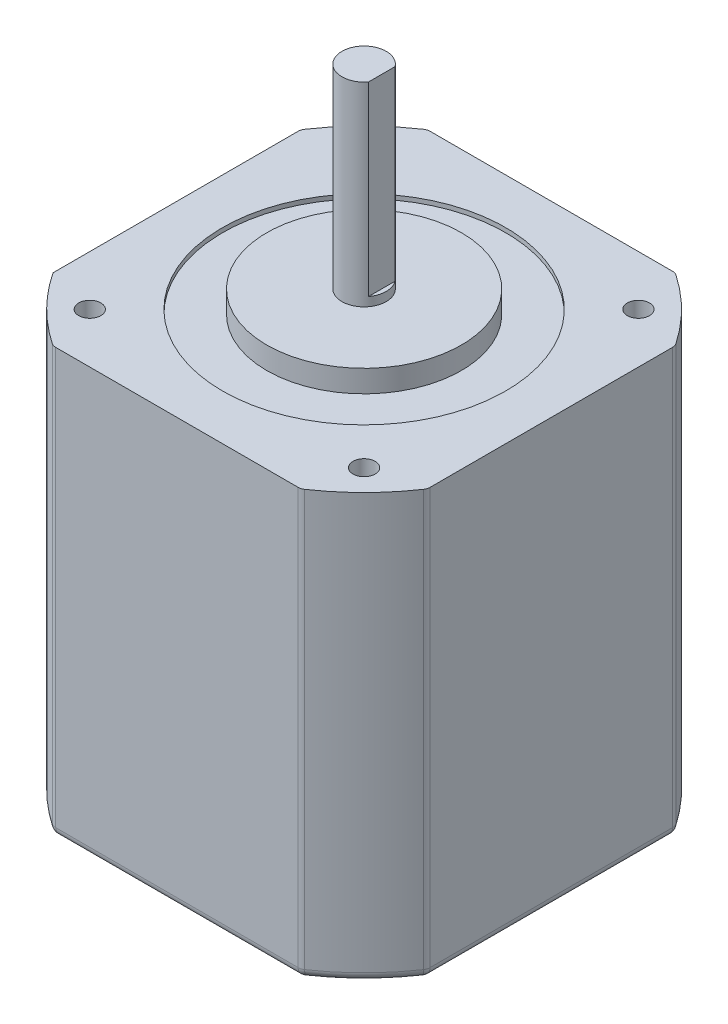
ISO-10303-21;
HEADER;
FILE_DESCRIPTION(('STEP AP214'),'2;1');
FILE_NAME('part.step','',(''),(''),'','','');
FILE_SCHEMA(('AUTOMOTIVE_DESIGN { 1 0 10303 214 1 1 1 1 }'));
ENDSEC;
DATA;
#1=APPLICATION_CONTEXT('core data for automotive mechanical design processes');
#2=APPLICATION_PROTOCOL_DEFINITION('international standard','automotive_design',2000,#1);
#3=PRODUCT_CONTEXT('',#1,'mechanical');
#4=PRODUCT('Part','Part','',(#3));
#5=PRODUCT_RELATED_PRODUCT_CATEGORY('part','',(#4));
#6=PRODUCT_DEFINITION_FORMATION('','',#4);
#7=PRODUCT_DEFINITION_CONTEXT('part definition',#1,'design');
#8=PRODUCT_DEFINITION('design','',#6,#7);
#9=PRODUCT_DEFINITION_SHAPE('','',#8);
#10=(LENGTH_UNIT() NAMED_UNIT(*) SI_UNIT(.MILLI.,.METRE.));
#11=(NAMED_UNIT(*) PLANE_ANGLE_UNIT() SI_UNIT($,.RADIAN.));
#12=(NAMED_UNIT(*) SI_UNIT($,.STERADIAN.) SOLID_ANGLE_UNIT());
#13=UNCERTAINTY_MEASURE_WITH_UNIT(LENGTH_MEASURE(1.E-05),#10,'distance_accuracy_value','');
#14=(GEOMETRIC_REPRESENTATION_CONTEXT(3) GLOBAL_UNCERTAINTY_ASSIGNED_CONTEXT((#13)) GLOBAL_UNIT_ASSIGNED_CONTEXT((#10,
#11,#12)) REPRESENTATION_CONTEXT('',''));
#15=CARTESIAN_POINT('',(0.,0.,0.));
#16=DIRECTION('',(0.,0.,1.));
#17=DIRECTION('',(1.,0.,0.));
#18=AXIS2_PLACEMENT_3D('',#15,#16,#17);
#19=CARTESIAN_POINT('',(0.,50.,0.));
#20=DIRECTION('',(0.,-1.,0.));
#21=DIRECTION('',(0.,0.,-1.));
#22=AXIS2_PLACEMENT_3D('',#19,#20,#21);
#23=CYLINDRICAL_SURFACE('',#22,11.);
#24=CARTESIAN_POINT('',(0.,50.,0.));
#25=DIRECTION('',(0.,1.,0.));
#26=DIRECTION('',(0.,0.,1.));
#27=AXIS2_PLACEMENT_3D('',#24,#25,#26);
#28=CIRCLE('',#27,11.);
#29=CARTESIAN_POINT('',(0.,50.,11.));
#30=VERTEX_POINT('',#29);
#31=EDGE_CURVE('E241',#30,#30,#28,.T.);
#32=ORIENTED_EDGE('',*,*,#31,.F.);
#33=EDGE_LOOP('',(#32));
#34=FACE_BOUND('',#33,.T.);
#35=CARTESIAN_POINT('',(0.,47.5,0.));
#36=DIRECTION('',(0.,1.,0.));
#37=DIRECTION('',(0.,0.,1.));
#38=AXIS2_PLACEMENT_3D('',#35,#36,#37);
#39=CIRCLE('',#38,11.);
#40=CARTESIAN_POINT('',(0.,47.5,11.));
#41=VERTEX_POINT('',#40);
#42=EDGE_CURVE('E569',#41,#41,#39,.T.);
#43=ORIENTED_EDGE('',*,*,#42,.T.);
#44=EDGE_LOOP('',(#43));
#45=FACE_BOUND('',#44,.T.);
#46=ADVANCED_FACE('F38',(#34,#45),#23,.T.);
#47=CARTESIAN_POINT('',(0.,50.,0.));
#48=DIRECTION('',(0.,1.,0.));
#49=DIRECTION('',(0.,0.,1.));
#50=AXIS2_PLACEMENT_3D('',#47,#48,#49);
#51=PLANE('',#50);
#52=CARTESIAN_POINT('',(0.,50.,0.));
#53=DIRECTION('',(0.,1.,0.));
#54=DIRECTION('',(0.,0.,1.));
#55=AXIS2_PLACEMENT_3D('',#52,#53,#54);
#56=CIRCLE('',#55,2.5);
#57=CARTESIAN_POINT('',(0.,50.,2.5));
#58=VERTEX_POINT('',#57);
#59=EDGE_CURVE('E236',#58,#58,#56,.T.);
#60=ORIENTED_EDGE('',*,*,#59,.F.);
#61=EDGE_LOOP('',(#60));
#62=FACE_BOUND('',#61,.T.);
#63=ORIENTED_EDGE('',*,*,#31,.T.);
#64=EDGE_LOOP('',(#63));
#65=FACE_BOUND('',#64,.T.);
#66=ADVANCED_FACE('F444',(#62,#65),#51,.T.);
#67=CARTESIAN_POINT('',(0.,72.0000000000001,0.));
#68=DIRECTION('',(0.,-1.,0.));
#69=DIRECTION('',(0.,0.,-1.));
#70=AXIS2_PLACEMENT_3D('',#67,#68,#69);
#71=CYLINDRICAL_SURFACE('',#70,2.5);
#72=CARTESIAN_POINT('',(0.,72.0000000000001,0.));
#73=DIRECTION('',(0.,1.,0.));
#74=DIRECTION('',(0.,0.,1.));
#75=AXIS2_PLACEMENT_3D('',#72,#73,#74);
#76=CIRCLE('',#75,2.5);
#77=CARTESIAN_POINT('',(2.,72.0000000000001,-1.5));
#78=VERTEX_POINT('',#77);
#79=CARTESIAN_POINT('',(2.,72.0000000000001,1.5));
#80=VERTEX_POINT('',#79);
#81=EDGE_CURVE('E238',#78,#80,#76,.T.);
#82=ORIENTED_EDGE('',*,*,#81,.F.);
#83=DIRECTION('',(0.,1.,0.));
#84=VECTOR('',#83,1.);
#85=CARTESIAN_POINT('',(2.,51.,-1.5));
#86=LINE('',#85,#84);
#87=CARTESIAN_POINT('',(2.,51.,-1.5));
#88=VERTEX_POINT('',#87);
#89=EDGE_CURVE('E231',#88,#78,#86,.T.);
#90=ORIENTED_EDGE('',*,*,#89,.F.);
#91=CARTESIAN_POINT('',(0.,51.,0.));
#92=DIRECTION('',(0.,1.,0.));
#93=DIRECTION('',(0.,0.,1.));
#94=AXIS2_PLACEMENT_3D('',#91,#92,#93);
#95=CIRCLE('',#94,2.5);
#96=CARTESIAN_POINT('',(2.,51.,1.5));
#97=VERTEX_POINT('',#96);
#98=EDGE_CURVE('E272',#97,#88,#95,.T.);
#99=ORIENTED_EDGE('',*,*,#98,.F.);
#100=DIRECTION('',(0.,1.,0.));
#101=VECTOR('',#100,1.);
#102=CARTESIAN_POINT('',(2.,51.,1.5));
#103=LINE('',#102,#101);
#104=EDGE_CURVE('E233',#97,#80,#103,.T.);
#105=ORIENTED_EDGE('',*,*,#104,.T.);
#106=EDGE_LOOP('',(#82,#90,#99,#105));
#107=FACE_BOUND('',#106,.T.);
#108=ORIENTED_EDGE('',*,*,#59,.T.);
#109=EDGE_LOOP('',(#108));
#110=FACE_BOUND('',#109,.T.);
#111=ADVANCED_FACE('F450',(#107,#110),#71,.T.);
#112=CARTESIAN_POINT('',(0.,72.0000000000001,0.));
#113=DIRECTION('',(0.,1.,0.));
#114=DIRECTION('',(0.,0.,1.));
#115=AXIS2_PLACEMENT_3D('',#112,#113,#114);
#116=PLANE('',#115);
#117=DIRECTION('',(0.,0.,1.));
#118=VECTOR('',#117,1.);
#119=CARTESIAN_POINT('',(2.,72.0000000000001,-1.5));
#120=LINE('',#119,#118);
#121=EDGE_CURVE('E227',#78,#80,#120,.T.);
#122=ORIENTED_EDGE('',*,*,#121,.F.);
#123=ORIENTED_EDGE('',*,*,#81,.T.);
#124=EDGE_LOOP('',(#122,#123));
#125=FACE_BOUND('',#124,.T.);
#126=ADVANCED_FACE('F878',(#125),#116,.T.);
#127=CARTESIAN_POINT('',(0.,51.,0.));
#128=DIRECTION('',(0.,1.,0.));
#129=DIRECTION('',(0.,0.,1.));
#130=AXIS2_PLACEMENT_3D('',#127,#128,#129);
#131=PLANE('',#130);
#132=DIRECTION('',(0.,0.,1.));
#133=VECTOR('',#132,1.);
#134=CARTESIAN_POINT('',(2.,51.,-1.5));
#135=LINE('',#134,#133);
#136=EDGE_CURVE('E228',#88,#97,#135,.T.);
#137=ORIENTED_EDGE('',*,*,#136,.T.);
#138=ORIENTED_EDGE('',*,*,#98,.T.);
#139=EDGE_LOOP('',(#137,#138));
#140=FACE_BOUND('',#139,.T.);
#141=ADVANCED_FACE('F868',(#140),#131,.T.);
#142=CARTESIAN_POINT('',(2.,51.,-1.5));
#143=DIRECTION('',(-1.,0.,0.));
#144=DIRECTION('',(0.,0.,1.));
#145=AXIS2_PLACEMENT_3D('',#142,#143,#144);
#146=PLANE('',#145);
#147=ORIENTED_EDGE('',*,*,#121,.T.);
#148=ORIENTED_EDGE('',*,*,#104,.F.);
#149=ORIENTED_EDGE('',*,*,#136,.F.);
#150=ORIENTED_EDGE('',*,*,#89,.T.);
#151=EDGE_LOOP('',(#147,#148,#149,#150));
#152=FACE_BOUND('',#151,.T.);
#153=ADVANCED_FACE('F584',(#152),#146,.F.);
#154=CARTESIAN_POINT('',(0.,47.5,0.));
#155=DIRECTION('',(0.,1.,0.));
#156=DIRECTION('',(0.,0.,1.));
#157=AXIS2_PLACEMENT_3D('',#154,#155,#156);
#158=CYLINDRICAL_SURFACE('',#157,16.);
#159=CARTESIAN_POINT('',(0.,47.5,0.));
#160=DIRECTION('',(0.,1.,0.));
#161=DIRECTION('',(0.,0.,1.));
#162=AXIS2_PLACEMENT_3D('',#159,#160,#161);
#163=CIRCLE('',#162,16.);
#164=CARTESIAN_POINT('',(0.,47.5,16.));
#165=VERTEX_POINT('',#164);
#166=EDGE_CURVE('E209',#165,#165,#163,.T.);
#167=ORIENTED_EDGE('',*,*,#166,.F.);
#168=EDGE_LOOP('',(#167));
#169=FACE_BOUND('',#168,.T.);
#170=CARTESIAN_POINT('',(0.,48.,0.));
#171=DIRECTION('',(0.,1.,0.));
#172=DIRECTION('',(0.,0.,1.));
#173=AXIS2_PLACEMENT_3D('',#170,#171,#172);
#174=CIRCLE('',#173,16.);
#175=CARTESIAN_POINT('',(0.,48.,16.));
#176=VERTEX_POINT('',#175);
#177=EDGE_CURVE('E572',#176,#176,#174,.T.);
#178=ORIENTED_EDGE('',*,*,#177,.T.);
#179=EDGE_LOOP('',(#178));
#180=FACE_BOUND('',#179,.T.);
#181=ADVANCED_FACE('F581',(#169,#180),#158,.F.);
#182=CARTESIAN_POINT('',(0.,47.5,0.));
#183=DIRECTION('',(0.,1.,0.));
#184=DIRECTION('',(0.,0.,1.));
#185=AXIS2_PLACEMENT_3D('',#182,#183,#184);
#186=PLANE('',#185);
#187=ORIENTED_EDGE('',*,*,#42,.F.);
#188=EDGE_LOOP('',(#187));
#189=FACE_BOUND('',#188,.T.);
#190=ORIENTED_EDGE('',*,*,#166,.T.);
#191=EDGE_LOOP('',(#190));
#192=FACE_BOUND('',#191,.T.);
#193=ADVANCED_FACE('F465',(#189,#192),#186,.T.);
#194=CARTESIAN_POINT('',(0.,0.,0.));
#195=DIRECTION('',(0.,-1.,0.));
#196=DIRECTION('',(0.,0.,-1.));
#197=AXIS2_PLACEMENT_3D('',#194,#195,#196);
#198=PLANE('',#197);
#199=CARTESIAN_POINT('',(0.,0.,0.));
#200=DIRECTION('',(0.,-1.,0.));
#201=DIRECTION('',(0.,0.,-1.));
#202=AXIS2_PLACEMENT_3D('',#199,#200,#201);
#203=CIRCLE('',#202,24.3636553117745);
#204=CARTESIAN_POINT('',(-20.15,0.,-13.6954445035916));
#205=VERTEX_POINT('',#204);
#206=CARTESIAN_POINT('',(-13.6954445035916,0.,-20.15));
#207=VERTEX_POINT('',#206);
#208=EDGE_CURVE('E293',#205,#207,#203,.T.);
#209=ORIENTED_EDGE('',*,*,#208,.T.);
#210=DIRECTION('',(-1.,0.,0.));
#211=VECTOR('',#210,1.);
#212=CARTESIAN_POINT('',(13.9997325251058,0.,-20.15));
#213=LINE('',#212,#211);
#214=CARTESIAN_POINT('',(13.6954445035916,0.,-20.15));
#215=VERTEX_POINT('',#214);
#216=EDGE_CURVE('E295',#207,#215,#213,.F.);
#217=ORIENTED_EDGE('',*,*,#216,.T.);
#218=CARTESIAN_POINT('',(0.,0.,0.));
#219=DIRECTION('',(0.,-1.,0.));
#220=DIRECTION('',(0.,0.,-1.));
#221=AXIS2_PLACEMENT_3D('',#218,#219,#220);
#222=CIRCLE('',#221,24.3636553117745);
#223=CARTESIAN_POINT('',(20.15,0.,-13.6954445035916));
#224=VERTEX_POINT('',#223);
#225=EDGE_CURVE('E281',#215,#224,#222,.T.);
#226=ORIENTED_EDGE('',*,*,#225,.T.);
#227=DIRECTION('',(0.,0.,-1.));
#228=VECTOR('',#227,1.);
#229=CARTESIAN_POINT('',(20.15,0.,13.9997325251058));
#230=LINE('',#229,#228);
#231=CARTESIAN_POINT('',(20.15,0.,13.6954445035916));
#232=VERTEX_POINT('',#231);
#233=EDGE_CURVE('E283',#224,#232,#230,.F.);
#234=ORIENTED_EDGE('',*,*,#233,.T.);
#235=CARTESIAN_POINT('',(0.,0.,0.));
#236=DIRECTION('',(0.,-1.,0.));
#237=DIRECTION('',(0.,0.,-1.));
#238=AXIS2_PLACEMENT_3D('',#235,#236,#237);
#239=CIRCLE('',#238,24.3636553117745);
#240=CARTESIAN_POINT('',(13.6954445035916,0.,20.15));
#241=VERTEX_POINT('',#240);
#242=EDGE_CURVE('E285',#232,#241,#239,.T.);
#243=ORIENTED_EDGE('',*,*,#242,.T.);
#244=DIRECTION('',(1.,0.,0.));
#245=VECTOR('',#244,1.);
#246=CARTESIAN_POINT('',(-13.9997325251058,0.,20.15));
#247=LINE('',#246,#245);
#248=CARTESIAN_POINT('',(-13.6954445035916,0.,20.15));
#249=VERTEX_POINT('',#248);
#250=EDGE_CURVE('E287',#241,#249,#247,.F.);
#251=ORIENTED_EDGE('',*,*,#250,.T.);
#252=CARTESIAN_POINT('',(0.,0.,0.));
#253=DIRECTION('',(0.,-1.,0.));
#254=DIRECTION('',(0.,0.,-1.));
#255=AXIS2_PLACEMENT_3D('',#252,#253,#254);
#256=CIRCLE('',#255,24.3636553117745);
#257=CARTESIAN_POINT('',(-20.15,0.,13.6954445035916));
#258=VERTEX_POINT('',#257);
#259=EDGE_CURVE('E289',#249,#258,#256,.T.);
#260=ORIENTED_EDGE('',*,*,#259,.T.);
#261=DIRECTION('',(0.,0.,1.));
#262=VECTOR('',#261,1.);
#263=CARTESIAN_POINT('',(-20.15,0.,-13.9997325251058));
#264=LINE('',#263,#262);
#265=EDGE_CURVE('E291',#258,#205,#264,.F.);
#266=ORIENTED_EDGE('',*,*,#265,.T.);
#267=EDGE_LOOP('',(#209,#217,#226,#234,#243,#251,#260,#266));
#268=FACE_BOUND('',#267,.T.);
#269=ADVANCED_FACE('F461',(#268),#198,.T.);
#270=CARTESIAN_POINT('',(-15.5,42.5,-15.5));
#271=DIRECTION('',(0.,1.,0.));
#272=DIRECTION('',(0.,0.,1.));
#273=AXIS2_PLACEMENT_3D('',#270,#271,#272);
#274=CONICAL_SURFACE('',#273,1.25,1.02974425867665);
#275=CARTESIAN_POINT('',(-15.5,41.7489242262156,-15.5));
#276=VERTEX_POINT('',#275);
#277=VERTEX_LOOP('',#276);
#278=FACE_BOUND('',#277,.T.);
#279=CARTESIAN_POINT('',(-15.5,42.5,-15.5));
#280=DIRECTION('',(0.,1.,0.));
#281=DIRECTION('',(0.,0.,1.));
#282=AXIS2_PLACEMENT_3D('',#279,#280,#281);
#283=CIRCLE('',#282,1.25);
#284=CARTESIAN_POINT('',(-15.5,42.5,-14.25));
#285=VERTEX_POINT('',#284);
#286=EDGE_CURVE('E224',#285,#285,#283,.T.);
#287=ORIENTED_EDGE('',*,*,#286,.T.);
#288=EDGE_LOOP('',(#287));
#289=FACE_BOUND('',#288,.T.);
#290=ADVANCED_FACE('F464',(#278,#289),#274,.F.);
#291=CARTESIAN_POINT('',(15.5,42.5,-15.5));
#292=DIRECTION('',(0.,1.,0.));
#293=DIRECTION('',(0.,0.,1.));
#294=AXIS2_PLACEMENT_3D('',#291,#292,#293);
#295=CONICAL_SURFACE('',#294,1.25,1.02974425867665);
#296=CARTESIAN_POINT('',(15.5,41.7489242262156,-15.5));
#297=VERTEX_POINT('',#296);
#298=VERTEX_LOOP('',#297);
#299=FACE_BOUND('',#298,.T.);
#300=CARTESIAN_POINT('',(15.5,42.5,-15.5));
#301=DIRECTION('',(0.,1.,0.));
#302=DIRECTION('',(0.,0.,1.));
#303=AXIS2_PLACEMENT_3D('',#300,#301,#302);
#304=CIRCLE('',#303,1.25);
#305=CARTESIAN_POINT('',(15.5,42.5,-14.25));
#306=VERTEX_POINT('',#305);
#307=EDGE_CURVE('E218',#306,#306,#304,.T.);
#308=ORIENTED_EDGE('',*,*,#307,.T.);
#309=EDGE_LOOP('',(#308));
#310=FACE_BOUND('',#309,.T.);
#311=ADVANCED_FACE('F827',(#299,#310),#295,.F.);
#312=CARTESIAN_POINT('',(15.5,42.5,15.5));
#313=DIRECTION('',(0.,1.,0.));
#314=DIRECTION('',(0.,0.,1.));
#315=AXIS2_PLACEMENT_3D('',#312,#313,#314);
#316=CONICAL_SURFACE('',#315,1.25,1.02974425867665);
#317=CARTESIAN_POINT('',(15.5,41.7489242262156,15.5));
#318=VERTEX_POINT('',#317);
#319=VERTEX_LOOP('',#318);
#320=FACE_BOUND('',#319,.T.);
#321=CARTESIAN_POINT('',(15.5,42.5,15.5));
#322=DIRECTION('',(0.,1.,0.));
#323=DIRECTION('',(0.,0.,1.));
#324=AXIS2_PLACEMENT_3D('',#321,#322,#323);
#325=CIRCLE('',#324,1.25);
#326=CARTESIAN_POINT('',(15.5,42.5,16.75));
#327=VERTEX_POINT('',#326);
#328=EDGE_CURVE('E206',#327,#327,#325,.T.);
#329=ORIENTED_EDGE('',*,*,#328,.T.);
#330=EDGE_LOOP('',(#329));
#331=FACE_BOUND('',#330,.T.);
#332=ADVANCED_FACE('F196',(#320,#331),#316,.F.);
#333=CARTESIAN_POINT('',(-15.5,42.5,15.5));
#334=DIRECTION('',(0.,1.,0.));
#335=DIRECTION('',(0.,0.,1.));
#336=AXIS2_PLACEMENT_3D('',#333,#334,#335);
#337=CONICAL_SURFACE('',#336,1.25,1.02974425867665);
#338=CARTESIAN_POINT('',(-15.5,41.7489242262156,15.5));
#339=VERTEX_POINT('',#338);
#340=VERTEX_LOOP('',#339);
#341=FACE_BOUND('',#340,.T.);
#342=CARTESIAN_POINT('',(-15.5,42.5,15.5));
#343=DIRECTION('',(0.,1.,0.));
#344=DIRECTION('',(0.,0.,1.));
#345=AXIS2_PLACEMENT_3D('',#342,#343,#344);
#346=CIRCLE('',#345,1.25);
#347=CARTESIAN_POINT('',(-15.5,42.5,16.75));
#348=VERTEX_POINT('',#347);
#349=EDGE_CURVE('E200',#348,#348,#346,.T.);
#350=ORIENTED_EDGE('',*,*,#349,.T.);
#351=EDGE_LOOP('',(#350));
#352=FACE_BOUND('',#351,.T.);
#353=ADVANCED_FACE('F192',(#341,#352),#337,.F.);
#354=CARTESIAN_POINT('',(21.15,48.,13.9997325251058));
#355=DIRECTION('',(-1.,0.,0.));
#356=DIRECTION('',(0.,0.,1.));
#357=AXIS2_PLACEMENT_3D('',#354,#355,#356);
#358=PLANE('',#357);
#359=DIRECTION('',(0.,0.,-1.));
#360=VECTOR('',#359,1.);
#361=CARTESIAN_POINT('',(21.15,1.,-13.9997325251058));
#362=LINE('',#361,#360);
#363=CARTESIAN_POINT('',(21.15,1.,13.6954445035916));
#364=VERTEX_POINT('',#363);
#365=CARTESIAN_POINT('',(21.15,1.,-13.6954445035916));
#366=VERTEX_POINT('',#365);
#367=EDGE_CURVE('E326',#364,#366,#362,.T.);
#368=ORIENTED_EDGE('',*,*,#367,.T.);
#369=DIRECTION('',(0.,-1.,0.));
#370=VECTOR('',#369,1.);
#371=CARTESIAN_POINT('',(21.15,48.,-13.6954445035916));
#372=LINE('',#371,#370);
#373=CARTESIAN_POINT('',(21.15,48.,-13.6954445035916));
#374=VERTEX_POINT('',#373);
#375=EDGE_CURVE('E328',#366,#374,#372,.F.);
#376=ORIENTED_EDGE('',*,*,#375,.T.);
#377=DIRECTION('',(0.,0.,-1.));
#378=VECTOR('',#377,1.);
#379=CARTESIAN_POINT('',(21.15,48.,13.9997325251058));
#380=LINE('',#379,#378);
#381=CARTESIAN_POINT('',(21.15,48.,13.6954445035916));
#382=VERTEX_POINT('',#381);
#383=EDGE_CURVE('E266',#382,#374,#380,.T.);
#384=ORIENTED_EDGE('',*,*,#383,.F.);
#385=DIRECTION('',(0.,-1.,0.));
#386=VECTOR('',#385,1.);
#387=CARTESIAN_POINT('',(21.15,48.,13.6954445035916));
#388=LINE('',#387,#386);
#389=EDGE_CURVE('E324',#382,#364,#388,.T.);
#390=ORIENTED_EDGE('',*,*,#389,.T.);
#391=EDGE_LOOP('',(#368,#376,#384,#390));
#392=FACE_BOUND('',#391,.T.);
#393=ADVANCED_FACE('F195',(#392),#358,.F.);
#394=CARTESIAN_POINT('',(0.,48.,0.));
#395=DIRECTION('',(0.,-1.,0.));
#396=DIRECTION('',(0.,0.,-1.));
#397=AXIS2_PLACEMENT_3D('',#394,#395,#396);
#398=CYLINDRICAL_SURFACE('',#397,25.3636553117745);
#399=CARTESIAN_POINT('',(0.,1.,0.));
#400=DIRECTION('',(0.,-1.,0.));
#401=DIRECTION('',(0.,0.,-1.));
#402=AXIS2_PLACEMENT_3D('',#399,#400,#401);
#403=CIRCLE('',#402,25.3636553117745);
#404=CARTESIAN_POINT('',(14.2575705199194,1.,20.9770515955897));
#405=VERTEX_POINT('',#404);
#406=CARTESIAN_POINT('',(20.9770515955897,1.,14.2575705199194));
#407=VERTEX_POINT('',#406);
#408=EDGE_CURVE('E320',#405,#407,#403,.F.);
#409=ORIENTED_EDGE('',*,*,#408,.T.);
#410=DIRECTION('',(0.,-1.,0.));
#411=VECTOR('',#410,1.);
#412=CARTESIAN_POINT('',(20.9770515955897,48.,14.2575705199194));
#413=LINE('',#412,#411);
#414=CARTESIAN_POINT('',(20.9770515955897,48.,14.2575705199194));
#415=VERTEX_POINT('',#414);
#416=EDGE_CURVE('E322',#407,#415,#413,.F.);
#417=ORIENTED_EDGE('',*,*,#416,.T.);
#418=CARTESIAN_POINT('',(0.,48.,0.));
#419=DIRECTION('',(0.,1.,0.));
#420=DIRECTION('',(0.,0.,1.));
#421=AXIS2_PLACEMENT_3D('',#418,#419,#420);
#422=CIRCLE('',#421,25.3636553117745);
#423=CARTESIAN_POINT('',(14.2575705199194,48.,20.9770515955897));
#424=VERTEX_POINT('',#423);
#425=EDGE_CURVE('E263',#424,#415,#422,.T.);
#426=ORIENTED_EDGE('',*,*,#425,.F.);
#427=DIRECTION('',(0.,-1.,0.));
#428=VECTOR('',#427,1.);
#429=CARTESIAN_POINT('',(14.2575705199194,48.,20.9770515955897));
#430=LINE('',#429,#428);
#431=EDGE_CURVE('E318',#424,#405,#430,.T.);
#432=ORIENTED_EDGE('',*,*,#431,.T.);
#433=EDGE_LOOP('',(#409,#417,#426,#432));
#434=FACE_BOUND('',#433,.T.);
#435=ADVANCED_FACE('F469',(#434),#398,.T.);
#436=CARTESIAN_POINT('',(13.9997325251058,48.,21.15));
#437=DIRECTION('',(0.,0.,-1.));
#438=DIRECTION('',(-1.,0.,0.));
#439=AXIS2_PLACEMENT_3D('',#436,#437,#438);
#440=PLANE('',#439);
#441=DIRECTION('',(1.,0.,0.));
#442=VECTOR('',#441,1.);
#443=CARTESIAN_POINT('',(13.9997325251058,1.,21.15));
#444=LINE('',#443,#442);
#445=CARTESIAN_POINT('',(-13.6954445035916,1.,21.15));
#446=VERTEX_POINT('',#445);
#447=CARTESIAN_POINT('',(13.6954445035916,1.,21.15));
#448=VERTEX_POINT('',#447);
#449=EDGE_CURVE('E314',#446,#448,#444,.T.);
#450=ORIENTED_EDGE('',*,*,#449,.T.);
#451=DIRECTION('',(0.,-1.,0.));
#452=VECTOR('',#451,1.);
#453=CARTESIAN_POINT('',(13.6954445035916,48.,21.15));
#454=LINE('',#453,#452);
#455=CARTESIAN_POINT('',(13.6954445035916,48.,21.15));
#456=VERTEX_POINT('',#455);
#457=EDGE_CURVE('E316',#448,#456,#454,.F.);
#458=ORIENTED_EDGE('',*,*,#457,.T.);
#459=DIRECTION('',(1.,0.,0.));
#460=VECTOR('',#459,1.);
#461=CARTESIAN_POINT('',(13.9997325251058,48.,21.15));
#462=LINE('',#461,#460);
#463=CARTESIAN_POINT('',(-13.6954445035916,48.,21.15));
#464=VERTEX_POINT('',#463);
#465=EDGE_CURVE('E260',#464,#456,#462,.T.);
#466=ORIENTED_EDGE('',*,*,#465,.F.);
#467=DIRECTION('',(0.,-1.,0.));
#468=VECTOR('',#467,1.);
#469=CARTESIAN_POINT('',(-13.6954445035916,48.,21.15));
#470=LINE('',#469,#468);
#471=EDGE_CURVE('E312',#464,#446,#470,.T.);
#472=ORIENTED_EDGE('',*,*,#471,.T.);
#473=EDGE_LOOP('',(#450,#458,#466,#472));
#474=FACE_BOUND('',#473,.T.);
#475=ADVANCED_FACE('F473',(#474),#440,.F.);
#476=CARTESIAN_POINT('',(0.,48.,0.));
#477=DIRECTION('',(0.,-1.,0.));
#478=DIRECTION('',(0.,0.,-1.));
#479=AXIS2_PLACEMENT_3D('',#476,#477,#478);
#480=CYLINDRICAL_SURFACE('',#479,25.3636553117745);
#481=DIRECTION('',(0.,-1.,0.));
#482=VECTOR('',#481,1.);
#483=CARTESIAN_POINT('',(-21.15,48.,13.9997325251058));
#484=LINE('',#483,#482);
#485=CARTESIAN_POINT('',(-21.15,48.,13.9997325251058));
#486=VERTEX_POINT('',#485);
#487=CARTESIAN_POINT('',(-21.15,1.,13.9997325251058));
#488=VERTEX_POINT('',#487);
#489=EDGE_CURVE('E269',#486,#488,#484,.T.);
#490=ORIENTED_EDGE('',*,*,#489,.T.);
#491=CARTESIAN_POINT('',(0.,1.,0.));
#492=DIRECTION('',(0.,-1.,0.));
#493=DIRECTION('',(0.,0.,-1.));
#494=AXIS2_PLACEMENT_3D('',#491,#492,#493);
#495=CIRCLE('',#494,25.3636553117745);
#496=CARTESIAN_POINT('',(-14.2575705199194,1.,20.9770515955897));
#497=VERTEX_POINT('',#496);
#498=EDGE_CURVE('E310',#488,#497,#495,.F.);
#499=ORIENTED_EDGE('',*,*,#498,.T.);
#500=DIRECTION('',(0.,-1.,0.));
#501=VECTOR('',#500,1.);
#502=CARTESIAN_POINT('',(-14.2575705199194,48.,20.9770515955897));
#503=LINE('',#502,#501);
#504=CARTESIAN_POINT('',(-14.2575705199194,48.,20.9770515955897));
#505=VERTEX_POINT('',#504);
#506=EDGE_CURVE('E308',#497,#505,#503,.F.);
#507=ORIENTED_EDGE('',*,*,#506,.T.);
#508=CARTESIAN_POINT('',(0.,48.,0.));
#509=DIRECTION('',(0.,1.,0.));
#510=DIRECTION('',(0.,0.,-1.));
#511=AXIS2_PLACEMENT_3D('',#508,#509,#510);
#512=CIRCLE('',#511,25.3636553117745);
#513=EDGE_CURVE('E257',#486,#505,#512,.T.);
#514=ORIENTED_EDGE('',*,*,#513,.F.);
#515=EDGE_LOOP('',(#490,#499,#507,#514));
#516=FACE_BOUND('',#515,.T.);
#517=ADVANCED_FACE('F477',(#516),#480,.T.);
#518=CARTESIAN_POINT('',(-21.15,48.,13.9997325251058));
#519=DIRECTION('',(1.,0.,0.));
#520=DIRECTION('',(0.,0.,-1.));
#521=AXIS2_PLACEMENT_3D('',#518,#519,#520);
#522=PLANE('',#521);
#523=DIRECTION('',(0.,-1.,0.));
#524=VECTOR('',#523,1.);
#525=CARTESIAN_POINT('',(-21.15,48.,-13.6954445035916));
#526=LINE('',#525,#524);
#527=CARTESIAN_POINT('',(-21.15,48.,-13.6954445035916));
#528=VERTEX_POINT('',#527);
#529=CARTESIAN_POINT('',(-21.15,1.,-13.6954445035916));
#530=VERTEX_POINT('',#529);
#531=EDGE_CURVE('E304',#528,#530,#526,.T.);
#532=ORIENTED_EDGE('',*,*,#531,.T.);
#533=DIRECTION('',(0.,0.,1.));
#534=VECTOR('',#533,1.);
#535=CARTESIAN_POINT('',(-21.15,1.,13.9997325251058));
#536=LINE('',#535,#534);
#537=EDGE_CURVE('E306',#530,#488,#536,.T.);
#538=ORIENTED_EDGE('',*,*,#537,.T.);
#539=ORIENTED_EDGE('',*,*,#489,.F.);
#540=DIRECTION('',(0.,0.,1.));
#541=VECTOR('',#540,1.);
#542=CARTESIAN_POINT('',(-21.15,48.,13.9997325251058));
#543=LINE('',#542,#541);
#544=EDGE_CURVE('E255',#528,#486,#543,.T.);
#545=ORIENTED_EDGE('',*,*,#544,.F.);
#546=EDGE_LOOP('',(#532,#538,#539,#545));
#547=FACE_BOUND('',#546,.T.);
#548=ADVANCED_FACE('F481',(#547),#522,.F.);
#549=CARTESIAN_POINT('',(0.,48.,0.));
#550=DIRECTION('',(0.,-1.,0.));
#551=DIRECTION('',(0.,0.,-1.));
#552=AXIS2_PLACEMENT_3D('',#549,#550,#551);
#553=CYLINDRICAL_SURFACE('',#552,25.3636553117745);
#554=CARTESIAN_POINT('',(0.,1.,0.));
#555=DIRECTION('',(0.,-1.,0.));
#556=DIRECTION('',(0.,0.,-1.));
#557=AXIS2_PLACEMENT_3D('',#554,#555,#556);
#558=CIRCLE('',#557,25.3636553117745);
#559=CARTESIAN_POINT('',(-14.2575705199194,1.,-20.9770515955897));
#560=VERTEX_POINT('',#559);
#561=CARTESIAN_POINT('',(-20.9770515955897,1.,-14.2575705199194));
#562=VERTEX_POINT('',#561);
#563=EDGE_CURVE('E300',#560,#562,#558,.F.);
#564=ORIENTED_EDGE('',*,*,#563,.T.);
#565=DIRECTION('',(0.,-1.,0.));
#566=VECTOR('',#565,1.);
#567=CARTESIAN_POINT('',(-20.9770515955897,48.,-14.2575705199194));
#568=LINE('',#567,#566);
#569=CARTESIAN_POINT('',(-20.9770515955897,48.,-14.2575705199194));
#570=VERTEX_POINT('',#569);
#571=EDGE_CURVE('E302',#562,#570,#568,.F.);
#572=ORIENTED_EDGE('',*,*,#571,.T.);
#573=CARTESIAN_POINT('',(0.,48.,0.));
#574=DIRECTION('',(0.,1.,0.));
#575=DIRECTION('',(0.,0.,1.));
#576=AXIS2_PLACEMENT_3D('',#573,#574,#575);
#577=CIRCLE('',#576,25.3636553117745);
#578=CARTESIAN_POINT('',(-14.2575705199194,48.,-20.9770515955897));
#579=VERTEX_POINT('',#578);
#580=EDGE_CURVE('E252',#579,#570,#577,.T.);
#581=ORIENTED_EDGE('',*,*,#580,.F.);
#582=DIRECTION('',(0.,-1.,0.));
#583=VECTOR('',#582,1.);
#584=CARTESIAN_POINT('',(-14.2575705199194,48.,-20.9770515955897));
#585=LINE('',#584,#583);
#586=EDGE_CURVE('E298',#579,#560,#585,.T.);
#587=ORIENTED_EDGE('',*,*,#586,.T.);
#588=EDGE_LOOP('',(#564,#572,#581,#587));
#589=FACE_BOUND('',#588,.T.);
#590=ADVANCED_FACE('F485',(#589),#553,.T.);
#591=CARTESIAN_POINT('',(13.9997325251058,48.,-21.15));
#592=DIRECTION('',(0.,0.,1.));
#593=DIRECTION('',(1.,0.,0.));
#594=AXIS2_PLACEMENT_3D('',#591,#592,#593);
#595=PLANE('',#594);
#596=DIRECTION('',(-1.,0.,0.));
#597=VECTOR('',#596,1.);
#598=CARTESIAN_POINT('',(-13.9997325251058,1.,-21.15));
#599=LINE('',#598,#597);
#600=CARTESIAN_POINT('',(13.6954445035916,1.,-21.15));
#601=VERTEX_POINT('',#600);
#602=CARTESIAN_POINT('',(-13.6954445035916,1.,-21.15));
#603=VERTEX_POINT('',#602);
#604=EDGE_CURVE('E276',#601,#603,#599,.T.);
#605=ORIENTED_EDGE('',*,*,#604,.T.);
#606=DIRECTION('',(0.,-1.,0.));
#607=VECTOR('',#606,1.);
#608=CARTESIAN_POINT('',(-13.6954445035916,48.,-21.15));
#609=LINE('',#608,#607);
#610=CARTESIAN_POINT('',(-13.6954445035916,48.,-21.15));
#611=VERTEX_POINT('',#610);
#612=EDGE_CURVE('E279',#603,#611,#609,.F.);
#613=ORIENTED_EDGE('',*,*,#612,.T.);
#614=DIRECTION('',(-1.,0.,0.));
#615=VECTOR('',#614,1.);
#616=CARTESIAN_POINT('',(13.9997325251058,48.,-21.15));
#617=LINE('',#616,#615);
#618=CARTESIAN_POINT('',(13.6954445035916,48.,-21.15));
#619=VERTEX_POINT('',#618);
#620=EDGE_CURVE('E249',#619,#611,#617,.T.);
#621=ORIENTED_EDGE('',*,*,#620,.F.);
#622=DIRECTION('',(0.,-1.,0.));
#623=VECTOR('',#622,1.);
#624=CARTESIAN_POINT('',(13.6954445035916,48.,-21.15));
#625=LINE('',#624,#623);
#626=EDGE_CURVE('E274',#619,#601,#625,.T.);
#627=ORIENTED_EDGE('',*,*,#626,.T.);
#628=EDGE_LOOP('',(#605,#613,#621,#627));
#629=FACE_BOUND('',#628,.T.);
#630=ADVANCED_FACE('F489',(#629),#595,.F.);
#631=CARTESIAN_POINT('',(0.,48.,0.));
#632=DIRECTION('',(0.,-1.,0.));
#633=DIRECTION('',(0.,0.,-1.));
#634=AXIS2_PLACEMENT_3D('',#631,#632,#633);
#635=CYLINDRICAL_SURFACE('',#634,25.3636553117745);
#636=CARTESIAN_POINT('',(0.,1.,0.));
#637=DIRECTION('',(0.,-1.,0.));
#638=DIRECTION('',(0.,0.,-1.));
#639=AXIS2_PLACEMENT_3D('',#636,#637,#638);
#640=CIRCLE('',#639,25.3636553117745);
#641=CARTESIAN_POINT('',(20.9770515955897,1.,-14.2575705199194));
#642=VERTEX_POINT('',#641);
#643=CARTESIAN_POINT('',(14.2575705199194,1.,-20.9770515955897));
#644=VERTEX_POINT('',#643);
#645=EDGE_CURVE('E55',#642,#644,#640,.F.);
#646=ORIENTED_EDGE('',*,*,#645,.T.);
#647=DIRECTION('',(0.,-1.,0.));
#648=VECTOR('',#647,1.);
#649=CARTESIAN_POINT('',(14.2575705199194,48.,-20.9770515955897));
#650=LINE('',#649,#648);
#651=CARTESIAN_POINT('',(14.2575705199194,48.,-20.9770515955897));
#652=VERTEX_POINT('',#651);
#653=EDGE_CURVE('E332',#644,#652,#650,.F.);
#654=ORIENTED_EDGE('',*,*,#653,.T.);
#655=CARTESIAN_POINT('',(0.,48.,0.));
#656=DIRECTION('',(0.,1.,0.));
#657=DIRECTION('',(0.,0.,-1.));
#658=AXIS2_PLACEMENT_3D('',#655,#656,#657);
#659=CIRCLE('',#658,25.3636553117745);
#660=CARTESIAN_POINT('',(20.9770515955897,48.,-14.2575705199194));
#661=VERTEX_POINT('',#660);
#662=EDGE_CURVE('E246',#661,#652,#659,.T.);
#663=ORIENTED_EDGE('',*,*,#662,.F.);
#664=DIRECTION('',(0.,-1.,0.));
#665=VECTOR('',#664,1.);
#666=CARTESIAN_POINT('',(20.9770515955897,48.,-14.2575705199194));
#667=LINE('',#666,#665);
#668=EDGE_CURVE('E60',#661,#642,#667,.T.);
#669=ORIENTED_EDGE('',*,*,#668,.T.);
#670=EDGE_LOOP('',(#646,#654,#663,#669));
#671=FACE_BOUND('',#670,.T.);
#672=ADVANCED_FACE('F493',(#671),#635,.T.);
#673=CARTESIAN_POINT('',(-15.5,48.,-15.5));
#674=DIRECTION('',(0.,1.,0.));
#675=DIRECTION('',(0.,0.,1.));
#676=AXIS2_PLACEMENT_3D('',#673,#674,#675);
#677=CYLINDRICAL_SURFACE('',#676,1.24999999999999);
#678=ORIENTED_EDGE('',*,*,#286,.F.);
#679=EDGE_LOOP('',(#678));
#680=FACE_BOUND('',#679,.T.);
#681=CARTESIAN_POINT('',(-15.5,48.,-15.5));
#682=DIRECTION('',(0.,1.,0.));
#683=DIRECTION('',(0.,0.,1.));
#684=AXIS2_PLACEMENT_3D('',#681,#682,#683);
#685=CIRCLE('',#684,1.24999999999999);
#686=CARTESIAN_POINT('',(-15.5,48.,-14.25));
#687=VERTEX_POINT('',#686);
#688=EDGE_CURVE('E221',#687,#687,#685,.T.);
#689=ORIENTED_EDGE('',*,*,#688,.T.);
#690=EDGE_LOOP('',(#689));
#691=FACE_BOUND('',#690,.T.);
#692=ADVANCED_FACE('F497',(#680,#691),#677,.F.);
#693=CARTESIAN_POINT('',(15.5,48.,-15.5));
#694=DIRECTION('',(0.,1.,0.));
#695=DIRECTION('',(0.,0.,1.));
#696=AXIS2_PLACEMENT_3D('',#693,#694,#695);
#697=CYLINDRICAL_SURFACE('',#696,1.24999999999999);
#698=ORIENTED_EDGE('',*,*,#307,.F.);
#699=EDGE_LOOP('',(#698));
#700=FACE_BOUND('',#699,.T.);
#701=CARTESIAN_POINT('',(15.5,48.,-15.5));
#702=DIRECTION('',(0.,1.,0.));
#703=DIRECTION('',(0.,0.,1.));
#704=AXIS2_PLACEMENT_3D('',#701,#702,#703);
#705=CIRCLE('',#704,1.24999999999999);
#706=CARTESIAN_POINT('',(15.5,48.,-14.25));
#707=VERTEX_POINT('',#706);
#708=EDGE_CURVE('E215',#707,#707,#705,.T.);
#709=ORIENTED_EDGE('',*,*,#708,.T.);
#710=EDGE_LOOP('',(#709));
#711=FACE_BOUND('',#710,.T.);
#712=ADVANCED_FACE('F817',(#700,#711),#697,.F.);
#713=CARTESIAN_POINT('',(15.5,48.,15.5));
#714=DIRECTION('',(0.,1.,0.));
#715=DIRECTION('',(0.,0.,1.));
#716=AXIS2_PLACEMENT_3D('',#713,#714,#715);
#717=CYLINDRICAL_SURFACE('',#716,1.24999999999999);
#718=ORIENTED_EDGE('',*,*,#328,.F.);
#719=EDGE_LOOP('',(#718));
#720=FACE_BOUND('',#719,.T.);
#721=CARTESIAN_POINT('',(15.5,48.,15.5));
#722=DIRECTION('',(0.,1.,0.));
#723=DIRECTION('',(0.,0.,1.));
#724=AXIS2_PLACEMENT_3D('',#721,#722,#723);
#725=CIRCLE('',#724,1.24999999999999);
#726=CARTESIAN_POINT('',(15.5,48.,16.75));
#727=VERTEX_POINT('',#726);
#728=EDGE_CURVE('E202',#727,#727,#725,.T.);
#729=ORIENTED_EDGE('',*,*,#728,.T.);
#730=EDGE_LOOP('',(#729));
#731=FACE_BOUND('',#730,.T.);
#732=ADVANCED_FACE('F800',(#720,#731),#717,.F.);
#733=CARTESIAN_POINT('',(-15.5,48.,15.5));
#734=DIRECTION('',(0.,1.,0.));
#735=DIRECTION('',(0.,0.,1.));
#736=AXIS2_PLACEMENT_3D('',#733,#734,#735);
#737=CYLINDRICAL_SURFACE('',#736,1.24999999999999);
#738=ORIENTED_EDGE('',*,*,#349,.F.);
#739=EDGE_LOOP('',(#738));
#740=FACE_BOUND('',#739,.T.);
#741=CARTESIAN_POINT('',(-15.5,48.,15.5));
#742=DIRECTION('',(0.,1.,0.));
#743=DIRECTION('',(0.,0.,1.));
#744=AXIS2_PLACEMENT_3D('',#741,#742,#743);
#745=CIRCLE('',#744,1.24999999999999);
#746=CARTESIAN_POINT('',(-15.5,48.,16.75));
#747=VERTEX_POINT('',#746);
#748=EDGE_CURVE('E203',#747,#747,#745,.T.);
#749=ORIENTED_EDGE('',*,*,#748,.T.);
#750=EDGE_LOOP('',(#749));
#751=FACE_BOUND('',#750,.T.);
#752=ADVANCED_FACE('F459',(#740,#751),#737,.F.);
#753=CARTESIAN_POINT('',(0.,48.,0.));
#754=DIRECTION('',(0.,-1.,0.));
#755=DIRECTION('',(0.,0.,-1.));
#756=AXIS2_PLACEMENT_3D('',#753,#754,#755);
#757=PLANE('',#756);
#758=ORIENTED_EDGE('',*,*,#177,.F.);
#759=EDGE_LOOP('',(#758));
#760=FACE_BOUND('',#759,.T.);
#761=ORIENTED_EDGE('',*,*,#748,.F.);
#762=EDGE_LOOP('',(#761));
#763=FACE_BOUND('',#762,.T.);
#764=ORIENTED_EDGE('',*,*,#728,.F.);
#765=EDGE_LOOP('',(#764));
#766=FACE_BOUND('',#765,.T.);
#767=ORIENTED_EDGE('',*,*,#708,.F.);
#768=EDGE_LOOP('',(#767));
#769=FACE_BOUND('',#768,.T.);
#770=ORIENTED_EDGE('',*,*,#688,.F.);
#771=EDGE_LOOP('',(#770));
#772=FACE_BOUND('',#771,.T.);
#773=ORIENTED_EDGE('',*,*,#580,.T.);
#774=CARTESIAN_POINT('',(-20.15,48.,-13.6954445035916));
#775=DIRECTION('',(0.,-1.,0.));
#776=DIRECTION('',(0.,0.,-1.));
#777=AXIS2_PLACEMENT_3D('',#774,#775,#776);
#778=CIRCLE('',#777,1.);
#779=EDGE_CURVE('E11',#570,#528,#778,.F.);
#780=ORIENTED_EDGE('',*,*,#779,.T.);
#781=ORIENTED_EDGE('',*,*,#544,.T.);
#782=ORIENTED_EDGE('',*,*,#513,.T.);
#783=CARTESIAN_POINT('',(-13.6954445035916,48.,20.15));
#784=DIRECTION('',(0.,-1.,0.));
#785=DIRECTION('',(0.,0.,-1.));
#786=AXIS2_PLACEMENT_3D('',#783,#784,#785);
#787=CIRCLE('',#786,1.);
#788=EDGE_CURVE('E334',#505,#464,#787,.F.);
#789=ORIENTED_EDGE('',*,*,#788,.T.);
#790=ORIENTED_EDGE('',*,*,#465,.T.);
#791=CARTESIAN_POINT('',(13.6954445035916,48.,20.15));
#792=DIRECTION('',(0.,-1.,0.));
#793=DIRECTION('',(0.,0.,-1.));
#794=AXIS2_PLACEMENT_3D('',#791,#792,#793);
#795=CIRCLE('',#794,1.);
#796=EDGE_CURVE('E336',#456,#424,#795,.F.);
#797=ORIENTED_EDGE('',*,*,#796,.T.);
#798=ORIENTED_EDGE('',*,*,#425,.T.);
#799=CARTESIAN_POINT('',(20.15,48.,13.6954445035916));
#800=DIRECTION('',(0.,-1.,0.));
#801=DIRECTION('',(0.,0.,-1.));
#802=AXIS2_PLACEMENT_3D('',#799,#800,#801);
#803=CIRCLE('',#802,1.);
#804=EDGE_CURVE('E338',#415,#382,#803,.F.);
#805=ORIENTED_EDGE('',*,*,#804,.T.);
#806=ORIENTED_EDGE('',*,*,#383,.T.);
#807=CARTESIAN_POINT('',(20.15,48.,-13.6954445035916));
#808=DIRECTION('',(0.,-1.,0.));
#809=DIRECTION('',(0.,0.,-1.));
#810=AXIS2_PLACEMENT_3D('',#807,#808,#809);
#811=CIRCLE('',#810,1.);
#812=EDGE_CURVE('E340',#374,#661,#811,.F.);
#813=ORIENTED_EDGE('',*,*,#812,.T.);
#814=ORIENTED_EDGE('',*,*,#662,.T.);
#815=CARTESIAN_POINT('',(13.6954445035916,48.,-20.15));
#816=DIRECTION('',(0.,-1.,0.));
#817=DIRECTION('',(0.,0.,-1.));
#818=AXIS2_PLACEMENT_3D('',#815,#816,#817);
#819=CIRCLE('',#818,1.);
#820=EDGE_CURVE('E342',#652,#619,#819,.F.);
#821=ORIENTED_EDGE('',*,*,#820,.T.);
#822=ORIENTED_EDGE('',*,*,#620,.T.);
#823=CARTESIAN_POINT('',(-13.6954445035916,48.,-20.15));
#824=DIRECTION('',(0.,-1.,0.));
#825=DIRECTION('',(0.,0.,-1.));
#826=AXIS2_PLACEMENT_3D('',#823,#824,#825);
#827=CIRCLE('',#826,1.);
#828=EDGE_CURVE('E47',#611,#579,#827,.F.);
#829=ORIENTED_EDGE('',*,*,#828,.T.);
#830=EDGE_LOOP('',(#773,#780,#781,#782,#789,#790,#797,#798,#805,#806,#813,#814,#821,#822,#829));
#831=FACE_BOUND('',#830,.T.);
#832=ADVANCED_FACE('F440',(#760,#763,#766,#769,#772,#831),#757,.F.);
#833=CARTESIAN_POINT('',(13.6954445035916,48.,20.15));
#834=DIRECTION('',(0.,-1.,0.));
#835=DIRECTION('',(0.,0.,-1.));
#836=AXIS2_PLACEMENT_3D('',#833,#834,#835);
#837=CYLINDRICAL_SURFACE('',#836,1.);
#838=CARTESIAN_POINT('',(13.6954445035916,1.,20.15));
#839=DIRECTION('',(0.,-1.,0.));
#840=DIRECTION('',(0.,0.,-1.));
#841=AXIS2_PLACEMENT_3D('',#838,#839,#840);
#842=CIRCLE('',#841,1.);
#843=EDGE_CURVE('E42',#405,#448,#842,.T.);
#844=ORIENTED_EDGE('',*,*,#843,.F.);
#845=ORIENTED_EDGE('',*,*,#431,.F.);
#846=ORIENTED_EDGE('',*,*,#796,.F.);
#847=ORIENTED_EDGE('',*,*,#457,.F.);
#848=EDGE_LOOP('',(#844,#845,#846,#847));
#849=FACE_BOUND('',#848,.T.);
#850=ADVANCED_FACE('F40',(#849),#837,.T.);
#851=CARTESIAN_POINT('',(13.6954445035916,1.,20.15));
#852=DIRECTION('',(0.,0.,1.));
#853=DIRECTION('',(1.,0.,0.));
#854=AXIS2_PLACEMENT_3D('',#851,#852,#853);
#855=SPHERICAL_SURFACE('',#854,1.);
#856=CARTESIAN_POINT('',(13.6954445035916,1.,20.15));
#857=DIRECTION('',(-0.82705159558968,0.,0.562126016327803));
#858=DIRECTION('',(0.562126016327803,0.,0.82705159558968));
#859=AXIS2_PLACEMENT_3D('',#856,#857,#858);
#860=CIRCLE('',#859,1.);
#861=EDGE_CURVE('E550',#405,#241,#860,.F.);
#862=ORIENTED_EDGE('',*,*,#861,.F.);
#863=ORIENTED_EDGE('',*,*,#843,.T.);
#864=CARTESIAN_POINT('',(13.6954445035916,1.,20.15));
#865=DIRECTION('',(1.,0.,0.));
#866=DIRECTION('',(0.,1.,0.));
#867=AXIS2_PLACEMENT_3D('',#864,#865,#866);
#868=CIRCLE('',#867,1.);
#869=EDGE_CURVE('E564',#241,#448,#868,.F.);
#870=ORIENTED_EDGE('',*,*,#869,.F.);
#871=EDGE_LOOP('',(#862,#863,#870));
#872=FACE_BOUND('',#871,.T.);
#873=ADVANCED_FACE('F433',(#872),#855,.T.);
#874=CARTESIAN_POINT('',(-13.6954445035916,48.,20.15));
#875=DIRECTION('',(0.,-1.,0.));
#876=DIRECTION('',(0.,0.,-1.));
#877=AXIS2_PLACEMENT_3D('',#874,#875,#876);
#878=CYLINDRICAL_SURFACE('',#877,1.);
#879=ORIENTED_EDGE('',*,*,#788,.F.);
#880=ORIENTED_EDGE('',*,*,#506,.F.);
#881=CARTESIAN_POINT('',(-13.6954445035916,1.,20.15));
#882=DIRECTION('',(0.,-1.,0.));
#883=DIRECTION('',(0.,0.,-1.));
#884=AXIS2_PLACEMENT_3D('',#881,#882,#883);
#885=CIRCLE('',#884,1.);
#886=EDGE_CURVE('E557',#446,#497,#885,.T.);
#887=ORIENTED_EDGE('',*,*,#886,.F.);
#888=ORIENTED_EDGE('',*,*,#471,.F.);
#889=EDGE_LOOP('',(#879,#880,#887,#888));
#890=FACE_BOUND('',#889,.T.);
#891=ADVANCED_FACE('F430',(#890),#878,.T.);
#892=CARTESIAN_POINT('',(13.9997325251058,1.,20.15));
#893=DIRECTION('',(-1.,0.,0.));
#894=DIRECTION('',(0.,0.,1.));
#895=AXIS2_PLACEMENT_3D('',#892,#893,#894);
#896=CYLINDRICAL_SURFACE('',#895,1.);
#897=ORIENTED_EDGE('',*,*,#869,.T.);
#898=ORIENTED_EDGE('',*,*,#449,.F.);
#899=CARTESIAN_POINT('',(-13.6954445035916,1.,20.15));
#900=DIRECTION('',(-1.,0.,0.));
#901=DIRECTION('',(0.,0.,1.));
#902=AXIS2_PLACEMENT_3D('',#899,#900,#901);
#903=CIRCLE('',#902,1.);
#904=EDGE_CURVE('E554',#249,#446,#903,.T.);
#905=ORIENTED_EDGE('',*,*,#904,.F.);
#906=ORIENTED_EDGE('',*,*,#250,.F.);
#907=EDGE_LOOP('',(#897,#898,#905,#906));
#908=FACE_BOUND('',#907,.T.);
#909=ADVANCED_FACE('F426',(#908),#896,.T.);
#910=CARTESIAN_POINT('',(0.,1.,0.));
#911=DIRECTION('',(0.,-1.,0.));
#912=DIRECTION('',(0.,0.,-1.));
#913=AXIS2_PLACEMENT_3D('',#910,#911,#912);
#914=TOROIDAL_SURFACE('',#913,24.3636553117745,1.);
#915=ORIENTED_EDGE('',*,*,#861,.T.);
#916=ORIENTED_EDGE('',*,*,#242,.F.);
#917=CARTESIAN_POINT('',(20.15,1.,13.6954445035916));
#918=DIRECTION('',(0.562126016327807,0.,-0.827051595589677));
#919=DIRECTION('',(-0.827051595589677,0.,-0.562126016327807));
#920=AXIS2_PLACEMENT_3D('',#917,#918,#919);
#921=CIRCLE('',#920,1.);
#922=EDGE_CURVE('E548',#407,#232,#921,.T.);
#923=ORIENTED_EDGE('',*,*,#922,.F.);
#924=ORIENTED_EDGE('',*,*,#408,.F.);
#925=EDGE_LOOP('',(#915,#916,#923,#924));
#926=FACE_BOUND('',#925,.T.);
#927=ADVANCED_FACE('F422',(#926),#914,.T.);
#928=CARTESIAN_POINT('',(20.15,48.,13.6954445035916));
#929=DIRECTION('',(0.,-1.,0.));
#930=DIRECTION('',(0.,0.,-1.));
#931=AXIS2_PLACEMENT_3D('',#928,#929,#930);
#932=CYLINDRICAL_SURFACE('',#931,1.);
#933=ORIENTED_EDGE('',*,*,#804,.F.);
#934=ORIENTED_EDGE('',*,*,#416,.F.);
#935=CARTESIAN_POINT('',(20.15,1.,13.6954445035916));
#936=DIRECTION('',(0.,-1.,0.));
#937=DIRECTION('',(0.,0.,-1.));
#938=AXIS2_PLACEMENT_3D('',#935,#936,#937);
#939=CIRCLE('',#938,1.);
#940=EDGE_CURVE('E553',#364,#407,#939,.T.);
#941=ORIENTED_EDGE('',*,*,#940,.F.);
#942=ORIENTED_EDGE('',*,*,#389,.F.);
#943=EDGE_LOOP('',(#933,#934,#941,#942));
#944=FACE_BOUND('',#943,.T.);
#945=ADVANCED_FACE('F418',(#944),#932,.T.);
#946=CARTESIAN_POINT('',(-13.6954445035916,1.,20.15));
#947=DIRECTION('',(0.,0.,1.));
#948=DIRECTION('',(1.,0.,0.));
#949=AXIS2_PLACEMENT_3D('',#946,#947,#948);
#950=SPHERICAL_SURFACE('',#949,1.);
#951=ORIENTED_EDGE('',*,*,#904,.T.);
#952=ORIENTED_EDGE('',*,*,#886,.T.);
#953=CARTESIAN_POINT('',(-13.6954445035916,1.,20.15));
#954=DIRECTION('',(0.827051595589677,0.,0.562126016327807));
#955=DIRECTION('',(0.562126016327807,0.,-0.827051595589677));
#956=AXIS2_PLACEMENT_3D('',#953,#954,#955);
#957=CIRCLE('',#956,1.);
#958=EDGE_CURVE('E559',#249,#497,#957,.F.);
#959=ORIENTED_EDGE('',*,*,#958,.F.);
#960=EDGE_LOOP('',(#951,#952,#959));
#961=FACE_BOUND('',#960,.T.);
#962=ADVANCED_FACE('F414',(#961),#950,.T.);
#963=CARTESIAN_POINT('',(20.15,1.,13.6954445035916));
#964=DIRECTION('',(0.,0.,1.));
#965=DIRECTION('',(1.,0.,0.));
#966=AXIS2_PLACEMENT_3D('',#963,#964,#965);
#967=SPHERICAL_SURFACE('',#966,1.);
#968=ORIENTED_EDGE('',*,*,#940,.T.);
#969=ORIENTED_EDGE('',*,*,#922,.T.);
#970=CARTESIAN_POINT('',(20.15,1.,13.6954445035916));
#971=DIRECTION('',(0.,0.,1.));
#972=DIRECTION('',(1.,0.,0.));
#973=AXIS2_PLACEMENT_3D('',#970,#971,#972);
#974=CIRCLE('',#973,1.);
#975=EDGE_CURVE('E388',#364,#232,#974,.F.);
#976=ORIENTED_EDGE('',*,*,#975,.F.);
#977=EDGE_LOOP('',(#968,#969,#976));
#978=FACE_BOUND('',#977,.T.);
#979=ADVANCED_FACE('F411',(#978),#967,.T.);
#980=CARTESIAN_POINT('',(0.,1.,0.));
#981=DIRECTION('',(0.,-1.,0.));
#982=DIRECTION('',(0.,0.,-1.));
#983=AXIS2_PLACEMENT_3D('',#980,#981,#982);
#984=TOROIDAL_SURFACE('',#983,24.3636553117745,1.);
#985=ORIENTED_EDGE('',*,*,#958,.T.);
#986=ORIENTED_EDGE('',*,*,#498,.F.);
#987=CARTESIAN_POINT('',(-21.15,1.,13.9997325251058));
#988=CARTESIAN_POINT('',(-21.1500004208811,0.97273478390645,13.9997326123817));
#989=CARTESIAN_POINT('',(-21.148884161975,0.94548294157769,13.9993966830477));
#990=CARTESIAN_POINT('',(-21.1444350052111,0.891180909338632,13.9980574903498));
#991=CARTESIAN_POINT('',(-21.1411023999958,0.864130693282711,13.9970543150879));
#992=CARTESIAN_POINT('',(-21.1278289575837,0.783681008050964,13.9930581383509));
#993=CARTESIAN_POINT('',(-21.1146122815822,0.730831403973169,13.9890784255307));
#994=CARTESIAN_POINT('',(-21.0799021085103,0.628219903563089,13.9786194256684));
#995=CARTESIAN_POINT('',(-21.0584080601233,0.578458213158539,13.9721399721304));
#996=CARTESIAN_POINT('',(-21.0078659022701,0.483311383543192,13.9568893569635));
#997=CARTESIAN_POINT('',(-20.9788169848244,0.437926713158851,13.948117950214));
#998=CARTESIAN_POINT('',(-20.913510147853,0.351909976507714,13.9283752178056));
#999=CARTESIAN_POINT('',(-20.8771331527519,0.31137684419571,13.917367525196));
#1000=CARTESIAN_POINT('',(-20.798609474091,0.236957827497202,13.8935731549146));
#1001=CARTESIAN_POINT('',(-20.7564608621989,0.203074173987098,13.8807858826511));
#1002=CARTESIAN_POINT('',(-20.6657966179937,0.141467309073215,13.8532370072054));
#1003=CARTESIAN_POINT('',(-20.6170926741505,0.114047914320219,13.8384165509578));
#1004=CARTESIAN_POINT('',(-20.5161115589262,0.0677742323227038,13.8076345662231));
#1005=CARTESIAN_POINT('',(-20.4638348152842,0.0489189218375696,13.7916731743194));
#1006=CARTESIAN_POINT('',(-20.3692542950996,0.0233957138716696,13.7627426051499));
#1007=CARTESIAN_POINT('',(-20.327377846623,0.0149335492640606,13.7499158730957));
#1008=CARTESIAN_POINT('',(-20.2430117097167,0.0034283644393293,13.7240375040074));
#1009=CARTESIAN_POINT('',(-20.2005233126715,0.00037525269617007,13.710986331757));
#1010=CARTESIAN_POINT('',(-20.155374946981,1.08081384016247E-05,13.6970981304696));
#1011=CARTESIAN_POINT('',(-20.1526873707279,-2.77574700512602E-08,13.6962713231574));
#1012=CARTESIAN_POINT('',(-20.15,0.,13.6954445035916));
#1013=B_SPLINE_CURVE_WITH_KNOTS('',3,(#987,#988,#989,#990,#991,#992,#993,#994,#995,#996,#997,
#998,#999,#1000,#1001,#1002,#1003,#1004,#1005,#1006,#1007,#1008,#1009,#1010,#1011,#1012),
.UNSPECIFIED.,.F.,.F.,(4,2,2,2,2,2,2,2,2,2,2,2,4),(0.,0.0817443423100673,0.163477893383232,
0.326497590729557,0.48952814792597,0.652576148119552,0.818525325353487,0.984530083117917,
1.15723455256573,1.32991838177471,1.46343534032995,1.59670293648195,1.60513854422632),.UNSPECIFIED.);
#1014=EDGE_CURVE('E379',#258,#488,#1013,.F.);
#1015=ORIENTED_EDGE('',*,*,#1014,.F.);
#1016=ORIENTED_EDGE('',*,*,#259,.F.);
#1017=EDGE_LOOP('',(#985,#986,#1015,#1016));
#1018=FACE_BOUND('',#1017,.T.);
#1019=ADVANCED_FACE('F390',(#1018),#984,.T.);
#1020=CARTESIAN_POINT('',(20.15,1.,13.9997325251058));
#1021=DIRECTION('',(0.,0.,1.));
#1022=DIRECTION('',(1.,0.,0.));
#1023=AXIS2_PLACEMENT_3D('',#1020,#1021,#1022);
#1024=CYLINDRICAL_SURFACE('',#1023,1.);
#1025=ORIENTED_EDGE('',*,*,#975,.T.);
#1026=ORIENTED_EDGE('',*,*,#233,.F.);
#1027=CARTESIAN_POINT('',(20.15,1.,-13.6954445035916));
#1028=DIRECTION('',(0.,0.,-1.));
#1029=DIRECTION('',(-1.,0.,0.));
#1030=AXIS2_PLACEMENT_3D('',#1027,#1028,#1029);
#1031=CIRCLE('',#1030,1.);
#1032=EDGE_CURVE('E376',#366,#224,#1031,.T.);
#1033=ORIENTED_EDGE('',*,*,#1032,.F.);
#1034=ORIENTED_EDGE('',*,*,#367,.F.);
#1035=EDGE_LOOP('',(#1025,#1026,#1033,#1034));
#1036=FACE_BOUND('',#1035,.T.);
#1037=ADVANCED_FACE('F406',(#1036),#1024,.T.);
#1038=CARTESIAN_POINT('',(20.15,48.,-13.6954445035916));
#1039=DIRECTION('',(0.,-1.,0.));
#1040=DIRECTION('',(0.,0.,-1.));
#1041=AXIS2_PLACEMENT_3D('',#1038,#1039,#1040);
#1042=CYLINDRICAL_SURFACE('',#1041,1.);
#1043=ORIENTED_EDGE('',*,*,#812,.F.);
#1044=ORIENTED_EDGE('',*,*,#375,.F.);
#1045=CARTESIAN_POINT('',(20.15,1.,-13.6954445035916));
#1046=DIRECTION('',(0.,-1.,0.));
#1047=DIRECTION('',(0.,0.,-1.));
#1048=AXIS2_PLACEMENT_3D('',#1045,#1046,#1047);
#1049=CIRCLE('',#1048,1.);
#1050=EDGE_CURVE('E373',#642,#366,#1049,.T.);
#1051=ORIENTED_EDGE('',*,*,#1050,.F.);
#1052=ORIENTED_EDGE('',*,*,#668,.F.);
#1053=EDGE_LOOP('',(#1043,#1044,#1051,#1052));
#1054=FACE_BOUND('',#1053,.T.);
#1055=ADVANCED_FACE('F402',(#1054),#1042,.T.);
#1056=CARTESIAN_POINT('',(-20.15,48.,-13.6954445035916));
#1057=DIRECTION('',(0.,-1.,0.));
#1058=DIRECTION('',(0.,0.,-1.));
#1059=AXIS2_PLACEMENT_3D('',#1056,#1057,#1058);
#1060=CYLINDRICAL_SURFACE('',#1059,1.);
#1061=ORIENTED_EDGE('',*,*,#779,.F.);
#1062=ORIENTED_EDGE('',*,*,#571,.F.);
#1063=CARTESIAN_POINT('',(-20.15,1.,-13.6954445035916));
#1064=DIRECTION('',(0.,-1.,0.));
#1065=DIRECTION('',(0.,0.,-1.));
#1066=AXIS2_PLACEMENT_3D('',#1063,#1064,#1065);
#1067=CIRCLE('',#1066,1.);
#1068=EDGE_CURVE('E370',#530,#562,#1067,.T.);
#1069=ORIENTED_EDGE('',*,*,#1068,.F.);
#1070=ORIENTED_EDGE('',*,*,#531,.F.);
#1071=EDGE_LOOP('',(#1061,#1062,#1069,#1070));
#1072=FACE_BOUND('',#1071,.T.);
#1073=ADVANCED_FACE('F398',(#1072),#1060,.T.);
#1074=CARTESIAN_POINT('',(-20.15,1.,13.9997325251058));
#1075=DIRECTION('',(0.,0.,-1.));
#1076=DIRECTION('',(-1.,0.,0.));
#1077=AXIS2_PLACEMENT_3D('',#1074,#1075,#1076);
#1078=CYLINDRICAL_SURFACE('',#1077,1.);
#1079=ORIENTED_EDGE('',*,*,#1014,.T.);
#1080=ORIENTED_EDGE('',*,*,#537,.F.);
#1081=CARTESIAN_POINT('',(-20.15,1.,-13.6954445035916));
#1082=DIRECTION('',(0.,0.,-1.));
#1083=DIRECTION('',(-1.,0.,0.));
#1084=AXIS2_PLACEMENT_3D('',#1081,#1082,#1083);
#1085=CIRCLE('',#1084,1.);
#1086=EDGE_CURVE('E367',#205,#530,#1085,.T.);
#1087=ORIENTED_EDGE('',*,*,#1086,.F.);
#1088=ORIENTED_EDGE('',*,*,#265,.F.);
#1089=EDGE_LOOP('',(#1079,#1080,#1087,#1088));
#1090=FACE_BOUND('',#1089,.T.);
#1091=ADVANCED_FACE('F393',(#1090),#1078,.T.);
#1092=CARTESIAN_POINT('',(20.15,1.,-13.6954445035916));
#1093=DIRECTION('',(0.,0.,1.));
#1094=DIRECTION('',(1.,0.,0.));
#1095=AXIS2_PLACEMENT_3D('',#1092,#1093,#1094);
#1096=SPHERICAL_SURFACE('',#1095,1.);
#1097=ORIENTED_EDGE('',*,*,#1050,.T.);
#1098=ORIENTED_EDGE('',*,*,#1032,.T.);
#1099=CARTESIAN_POINT('',(20.15,1.,-13.6954445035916));
#1100=DIRECTION('',(0.562126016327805,0.,0.827051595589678));
#1101=DIRECTION('',(0.827051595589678,0.,-0.562126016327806));
#1102=AXIS2_PLACEMENT_3D('',#1099,#1100,#1101);
#1103=CIRCLE('',#1102,1.);
#1104=EDGE_CURVE('E364',#642,#224,#1103,.F.);
#1105=ORIENTED_EDGE('',*,*,#1104,.F.);
#1106=EDGE_LOOP('',(#1097,#1098,#1105));
#1107=FACE_BOUND('',#1106,.T.);
#1108=ADVANCED_FACE('F397',(#1107),#1096,.T.);
#1109=CARTESIAN_POINT('',(-20.15,1.,-13.6954445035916));
#1110=DIRECTION('',(0.,0.,1.));
#1111=DIRECTION('',(1.,0.,0.));
#1112=AXIS2_PLACEMENT_3D('',#1109,#1110,#1111);
#1113=SPHERICAL_SURFACE('',#1112,1.);
#1114=ORIENTED_EDGE('',*,*,#1086,.T.);
#1115=ORIENTED_EDGE('',*,*,#1068,.T.);
#1116=CARTESIAN_POINT('',(-20.15,1.,-13.6954445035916));
#1117=DIRECTION('',(-0.562126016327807,0.,0.827051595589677));
#1118=DIRECTION('',(0.827051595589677,0.,0.562126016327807));
#1119=AXIS2_PLACEMENT_3D('',#1116,#1117,#1118);
#1120=CIRCLE('',#1119,1.);
#1121=EDGE_CURVE('E361',#205,#562,#1120,.F.);
#1122=ORIENTED_EDGE('',*,*,#1121,.F.);
#1123=EDGE_LOOP('',(#1114,#1115,#1122));
#1124=FACE_BOUND('',#1123,.T.);
#1125=ADVANCED_FACE('F525',(#1124),#1113,.T.);
#1126=CARTESIAN_POINT('',(0.,1.,0.));
#1127=DIRECTION('',(0.,-1.,0.));
#1128=DIRECTION('',(0.,0.,-1.));
#1129=AXIS2_PLACEMENT_3D('',#1126,#1127,#1128);
#1130=TOROIDAL_SURFACE('',#1129,24.3636553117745,1.);
#1131=ORIENTED_EDGE('',*,*,#1104,.T.);
#1132=ORIENTED_EDGE('',*,*,#225,.F.);
#1133=CARTESIAN_POINT('',(13.6954445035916,1.,-20.15));
#1134=DIRECTION('',(-0.827051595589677,0.,-0.562126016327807));
#1135=DIRECTION('',(-0.562126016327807,0.,0.827051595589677));
#1136=AXIS2_PLACEMENT_3D('',#1133,#1134,#1135);
#1137=CIRCLE('',#1136,1.);
#1138=EDGE_CURVE('E358',#644,#215,#1137,.T.);
#1139=ORIENTED_EDGE('',*,*,#1138,.F.);
#1140=ORIENTED_EDGE('',*,*,#645,.F.);
#1141=EDGE_LOOP('',(#1131,#1132,#1139,#1140));
#1142=FACE_BOUND('',#1141,.T.);
#1143=ADVANCED_FACE('F521',(#1142),#1130,.T.);
#1144=CARTESIAN_POINT('',(13.6954445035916,48.,-20.15));
#1145=DIRECTION('',(0.,-1.,0.));
#1146=DIRECTION('',(0.,0.,-1.));
#1147=AXIS2_PLACEMENT_3D('',#1144,#1145,#1146);
#1148=CYLINDRICAL_SURFACE('',#1147,1.);
#1149=ORIENTED_EDGE('',*,*,#820,.F.);
#1150=ORIENTED_EDGE('',*,*,#653,.F.);
#1151=CARTESIAN_POINT('',(13.6954445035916,1.,-20.15));
#1152=DIRECTION('',(0.,-1.,0.));
#1153=DIRECTION('',(0.,0.,-1.));
#1154=AXIS2_PLACEMENT_3D('',#1151,#1152,#1153);
#1155=CIRCLE('',#1154,1.);
#1156=EDGE_CURVE('E355',#601,#644,#1155,.T.);
#1157=ORIENTED_EDGE('',*,*,#1156,.F.);
#1158=ORIENTED_EDGE('',*,*,#626,.F.);
#1159=EDGE_LOOP('',(#1149,#1150,#1157,#1158));
#1160=FACE_BOUND('',#1159,.T.);
#1161=ADVANCED_FACE('F517',(#1160),#1148,.T.);
#1162=CARTESIAN_POINT('',(-13.6954445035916,48.,-20.15));
#1163=DIRECTION('',(0.,-1.,0.));
#1164=DIRECTION('',(0.,0.,-1.));
#1165=AXIS2_PLACEMENT_3D('',#1162,#1163,#1164);
#1166=CYLINDRICAL_SURFACE('',#1165,1.);
#1167=ORIENTED_EDGE('',*,*,#828,.F.);
#1168=ORIENTED_EDGE('',*,*,#612,.F.);
#1169=CARTESIAN_POINT('',(-13.6954445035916,1.,-20.15));
#1170=DIRECTION('',(0.,-1.,0.));
#1171=DIRECTION('',(0.,0.,-1.));
#1172=AXIS2_PLACEMENT_3D('',#1169,#1170,#1171);
#1173=CIRCLE('',#1172,1.);
#1174=EDGE_CURVE('E352',#560,#603,#1173,.T.);
#1175=ORIENTED_EDGE('',*,*,#1174,.F.);
#1176=ORIENTED_EDGE('',*,*,#586,.F.);
#1177=EDGE_LOOP('',(#1167,#1168,#1175,#1176));
#1178=FACE_BOUND('',#1177,.T.);
#1179=ADVANCED_FACE('F513',(#1178),#1166,.T.);
#1180=CARTESIAN_POINT('',(0.,1.,0.));
#1181=DIRECTION('',(0.,-1.,0.));
#1182=DIRECTION('',(0.,0.,-1.));
#1183=AXIS2_PLACEMENT_3D('',#1180,#1181,#1182);
#1184=TOROIDAL_SURFACE('',#1183,24.3636553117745,1.);
#1185=ORIENTED_EDGE('',*,*,#1121,.T.);
#1186=ORIENTED_EDGE('',*,*,#563,.F.);
#1187=CARTESIAN_POINT('',(-13.6954445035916,1.,-20.15));
#1188=DIRECTION('',(0.82705159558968,0.,-0.562126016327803));
#1189=DIRECTION('',(-0.562126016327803,0.,-0.82705159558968));
#1190=AXIS2_PLACEMENT_3D('',#1187,#1188,#1189);
#1191=CIRCLE('',#1190,1.);
#1192=EDGE_CURVE('E349',#207,#560,#1191,.T.);
#1193=ORIENTED_EDGE('',*,*,#1192,.F.);
#1194=ORIENTED_EDGE('',*,*,#208,.F.);
#1195=EDGE_LOOP('',(#1185,#1186,#1193,#1194));
#1196=FACE_BOUND('',#1195,.T.);
#1197=ADVANCED_FACE('F509',(#1196),#1184,.T.);
#1198=CARTESIAN_POINT('',(13.6954445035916,1.,-20.15));
#1199=DIRECTION('',(0.,0.,1.));
#1200=DIRECTION('',(1.,0.,0.));
#1201=AXIS2_PLACEMENT_3D('',#1198,#1199,#1200);
#1202=SPHERICAL_SURFACE('',#1201,1.);
#1203=ORIENTED_EDGE('',*,*,#1156,.T.);
#1204=ORIENTED_EDGE('',*,*,#1138,.T.);
#1205=CARTESIAN_POINT('',(13.6954445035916,1.,-20.15));
#1206=DIRECTION('',(1.,0.,0.));
#1207=DIRECTION('',(0.,0.,-1.));
#1208=AXIS2_PLACEMENT_3D('',#1205,#1206,#1207);
#1209=CIRCLE('',#1208,1.);
#1210=EDGE_CURVE('E347',#601,#215,#1209,.F.);
#1211=ORIENTED_EDGE('',*,*,#1210,.F.);
#1212=EDGE_LOOP('',(#1203,#1204,#1211));
#1213=FACE_BOUND('',#1212,.T.);
#1214=ADVANCED_FACE('F505',(#1213),#1202,.T.);
#1215=CARTESIAN_POINT('',(-13.6954445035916,1.,-20.15));
#1216=DIRECTION('',(0.,0.,1.));
#1217=DIRECTION('',(1.,0.,0.));
#1218=AXIS2_PLACEMENT_3D('',#1215,#1216,#1217);
#1219=SPHERICAL_SURFACE('',#1218,1.);
#1220=ORIENTED_EDGE('',*,*,#1192,.T.);
#1221=ORIENTED_EDGE('',*,*,#1174,.T.);
#1222=CARTESIAN_POINT('',(-13.6954445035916,1.,-20.15));
#1223=DIRECTION('',(-1.,0.,0.));
#1224=DIRECTION('',(0.,-1.,0.));
#1225=AXIS2_PLACEMENT_3D('',#1222,#1223,#1224);
#1226=CIRCLE('',#1225,1.);
#1227=EDGE_CURVE('E345',#207,#603,#1226,.F.);
#1228=ORIENTED_EDGE('',*,*,#1227,.F.);
#1229=EDGE_LOOP('',(#1220,#1221,#1228));
#1230=FACE_BOUND('',#1229,.T.);
#1231=ADVANCED_FACE('F501',(#1230),#1219,.T.);
#1232=CARTESIAN_POINT('',(13.9997325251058,1.,-20.15));
#1233=DIRECTION('',(1.,0.,0.));
#1234=DIRECTION('',(0.,0.,-1.));
#1235=AXIS2_PLACEMENT_3D('',#1232,#1233,#1234);
#1236=CYLINDRICAL_SURFACE('',#1235,1.);
#1237=ORIENTED_EDGE('',*,*,#1210,.T.);
#1238=ORIENTED_EDGE('',*,*,#216,.F.);
#1239=ORIENTED_EDGE('',*,*,#1227,.T.);
#1240=ORIENTED_EDGE('',*,*,#604,.F.);
#1241=EDGE_LOOP('',(#1237,#1238,#1239,#1240));
#1242=FACE_BOUND('',#1241,.T.);
#1243=ADVANCED_FACE('F498',(#1242),#1236,.T.);
#1244=CLOSED_SHELL('',(#46,#66,#111,#126,#141,#153,#181,#193,#269,#290,#311,#332,#353,#393,#435,
#475,#517,#548,#590,#630,#672,#692,#712,#732,#752,#832,#850,#873,#891,#909,#927,#945,#962,#979,
#1019,#1037,#1055,#1073,#1091,#1108,#1125,#1143,#1161,#1179,#1197,#1214,#1231,#1243));
#1245=MANIFOLD_SOLID_BREP('B2',#1244);
#1246=ADVANCED_BREP_SHAPE_REPRESENTATION('',(#18,#1245),#14);
#1247=SHAPE_DEFINITION_REPRESENTATION(#9,#1246);
ENDSEC;
END-ISO-10303-21;
